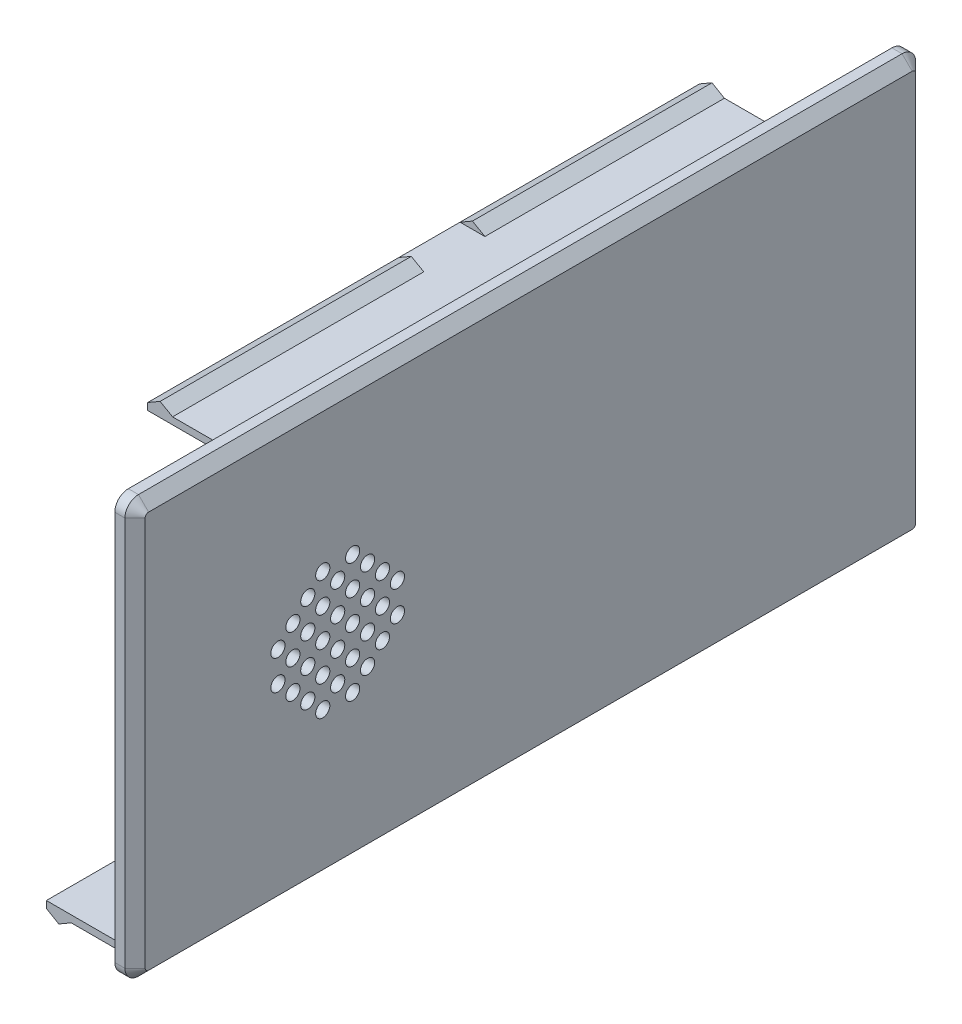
from build123d import *

# Parameters (mm, degrees)
SKETCH2_W                      = 99.1126
SKETCH2_H                      = 52.28
BOSS_EXTRUDE1_DEPTH            = 2.54
SKETCH3_W                      = 95.8426
SKETCH3_H                      = 48.58
SKETCH3_W_2                    = 94.1026
SKETCH3_H_2                    = 46.84
EXTRUDE_THIN1_DEPTH            = 0.762
BOSS_EXTRUDE2_DEPTH            = 95.8426
FILLET1_R                      = 1.7
SKETCH5_W                      = 3.885685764
SKETCH5_H                      = 7.665354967
CUT_EXTRUDE1_DEPTH             = 112.652948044
CUT_EXTRUDE2_DEPTH             = 112.652948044
CUT_EXTRUDE2_DEPTH_BACK        = 112.652948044
SKETCH6_W                      = 9.232419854
SKETCH6_H                      = 13.97
CHAMFER1_SIZE                  = 1.27
CUT_EXTRUDE3_REACH             = 113.653
SKETCH7_W                      = 9.232419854
SKETCH7_H                      = 12.7
CUT_EXTRUDE3_DIRECTION_2_REACH = 113.653
SKETCH8_R                      = 0.889
CUT_EXTRUDE5_DEPTH             = 2.54


with BuildPart() as part:
    # Sketch2 → Boss-Extrude1 (new body)
    with BuildSketch(Plane(origin=(0, 0, 0), x_dir=(0, 0, -1), z_dir=(1, 0, 0))):
        with Locations((49.5563, 26.14)):
            Rectangle(SKETCH2_W, SKETCH2_H)
    extrude(amount=BOSS_EXTRUDE1_DEPTH)

    # Sketch3 → Extrude-Thin1 (add)
    with BuildSketch(Plane.ZY):
        with Locations((-49.3413, 26.14)):
            Rectangle(SKETCH3_W, SKETCH3_H)
        with Locations((-49.3413, 26.14)):
            Rectangle(SKETCH3_W_2, SKETCH3_H_2, mode=Mode.SUBTRACT)
    extrude(amount=EXTRUDE_THIN1_DEPTH)

    # Sketch4 → Boss-Extrude2 (add)
    with BuildSketch(Plane.XY.offset(-1.42)):
        Polygon((-0.762, 50.43), (-6.876689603, 50.43), (-8.435554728, 51.3300112), (-9.994419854, 50.43), (-9.994419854, 49.56), (-0.762, 49.56), align=None)
    boss_extrude2 = extrude(amount=-BOSS_EXTRUDE2_DEPTH)

    # Fillet1
    fillet1_edges = [part.edges().sort_by_distance(p)[0] for p in [
        (1.27, 52.28, 0),
        (1.27, 52.28, -99.1126),
        (1.27, 0, -99.1126),
        (1.27, 0, 0),
    ]]
    fillet(fillet1_edges, radius=FILLET1_R)

    # Sketch5 → Cut-Extrude1 (cut, through all)
    with BuildSketch(Plane(origin=(0, 50.43, 0), x_dir=(1, 0, 0), z_dir=(0, 1, 0))):
        with Locations((-8.051576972, 49.437459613)):
            Rectangle(SKETCH5_W, SKETCH5_H)
    cut_extrude1 = extrude(amount=CUT_EXTRUDE1_DEPTH, mode=Mode.SUBTRACT)

    # Mirror3: Boss-Extrude2, Cut-Extrude1 across plane
    add(boss_extrude2.mirror(Plane.ZX.offset(26.14)))
    add(cut_extrude1.mirror(Plane.ZX.offset(26.14)), mode=Mode.SUBTRACT)

    # Sketch6 → Cut-Extrude2 (cut, two sides: drawn at the far end of the back side and taken through both)
    with BuildSketch(Plane(origin=(0, 50.43, 0), x_dir=(1, 0, 0), z_dir=(0, 1, 0)).offset(-CUT_EXTRUDE2_DEPTH_BACK)):
        with Locations((-5.378209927, 90.2776)):
            Rectangle(SKETCH6_W, SKETCH6_H)
    extrude(amount=CUT_EXTRUDE2_DEPTH + CUT_EXTRUDE2_DEPTH_BACK, mode=Mode.SUBTRACT)

    # Chamfer1
    chamfer1_edges = [part.edges().sort_by_distance(p)[0] for p in [
        (2.54, 26.14, 0),
        (2.54, 52.28, -49.5563),
        (2.54, 0, -49.5563),
        (2.54, 26.14, -99.1126),
        (2.54, 0.497918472, -98.614681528),
        (2.54, 51.782081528, -98.614681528),
        (2.54, 0.497918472, -0.497918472),
        (2.54, 51.782081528, -0.497918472),
    ]]
    chamfer(chamfer1_edges, length=CHAMFER1_SIZE)

    # Sketch7 → Cut-Extrude3 (cut, up to next)
    with BuildSketch(Plane(origin=(0, 50.43, 0), x_dir=(1, 0, 0), z_dir=(0, 1, 0)), mode=Mode.PRIVATE) as cut_extrude3_sk1:
        with Locations((-5.378209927, 7.77)):
            Rectangle(SKETCH7_W, SKETCH7_H)
    cut_extrude3_tool1 = extrude(cut_extrude3_sk1.sketch, amount=-CUT_EXTRUDE3_REACH, mode=Mode.PRIVATE) & part.part
    add(cut_extrude3_tool1.solids().sort_by_distance((-5.37821, 50.43, -7.77))[0], mode=Mode.SUBTRACT)

    # Sketch7 → Cut-Extrude3 direction 2 (cut, up to next)
    with BuildSketch(Plane(origin=(0, 50.43, 0), x_dir=(1, 0, 0), z_dir=(0, 1, 0)), mode=Mode.PRIVATE) as cut_extrude3_direction_2_sk1:
        with Locations((-5.378209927, 7.77)):
            Rectangle(SKETCH7_W, SKETCH7_H)
    cut_extrude3_direction_2_tool1 = extrude(cut_extrude3_direction_2_sk1.sketch, amount=CUT_EXTRUDE3_DIRECTION_2_REACH, mode=Mode.PRIVATE) & part.part
    add(cut_extrude3_direction_2_tool1.solids().sort_by_distance((-5.37821, 50.43, -7.77))[0], mode=Mode.SUBTRACT)

    # Sketch8 → Cut-Extrude5 (cut)
    with BuildSketch(Plane(origin=(2.54, 0, 0), x_dir=(0, 0, -1), z_dir=(1, 0, 0))):
        with Locations((27.272418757, 33.629675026)):
            Circle(SKETCH8_R)
        with Locations((23.527581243, 33.629675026)):
            Circle(SKETCH8_R)
        with Locations((29.144837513, 31.75725627)):
            Circle(SKETCH8_R)
        with Locations((31.01725627, 29.884837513)):
            Circle(SKETCH8_R)
        with Locations((25.4, 31.75725627)):
            Circle(SKETCH8_R)
        with Locations((27.272418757, 29.884837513)):
            Circle(SKETCH8_R)
        with Locations((21.655162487, 31.75725627)):
            Circle(SKETCH8_R)
        with Locations((23.527581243, 29.884837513)):
            Circle(SKETCH8_R)
        with Locations((19.78274373, 29.884837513)):
            Circle(SKETCH8_R)
        with Locations((29.144837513, 28.012418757)):
            Circle(SKETCH8_R)
        with Locations((31.01725627, 26.14)):
            Circle(SKETCH8_R)
        with Locations((25.4, 28.012418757)):
            Circle(SKETCH8_R)
        with Locations((27.272418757, 26.14)):
            Circle(SKETCH8_R)
        with Locations((21.655162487, 28.012418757)):
            Circle(SKETCH8_R)
        with Locations((23.527581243, 26.14)):
            Circle(SKETCH8_R)
        with Locations((17.910324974, 28.012418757)):
            Circle(SKETCH8_R)
        with Locations((19.78274373, 26.14)):
            Circle(SKETCH8_R)
        with Locations((29.144837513, 24.267581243)):
            Circle(SKETCH8_R)
        with Locations((31.01725627, 22.395162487)):
            Circle(SKETCH8_R)
        with Locations((25.4, 24.267581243)):
            Circle(SKETCH8_R)
        with Locations((27.272418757, 22.395162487)):
            Circle(SKETCH8_R)
        with Locations((21.655162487, 24.267581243)):
            Circle(SKETCH8_R)
        with Locations((23.527581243, 22.395162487)):
            Circle(SKETCH8_R)
        with Locations((17.910324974, 24.267581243)):
            Circle(SKETCH8_R)
        with Locations((19.78274373, 22.395162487)):
            Circle(SKETCH8_R)
        with Locations((29.144837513, 20.52274373)):
            Circle(SKETCH8_R)
        with Locations((25.4, 20.52274373)):
            Circle(SKETCH8_R)
        with Locations((27.272418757, 18.650324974)):
            Circle(SKETCH8_R)
        with Locations((21.655162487, 20.52274373)):
            Circle(SKETCH8_R)
        with Locations((23.527581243, 18.650324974)):
            Circle(SKETCH8_R)
        with Locations((32.889675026, 28.012418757)):
            Circle(SKETCH8_R)
        with Locations((32.889675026, 24.267581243)):
            Circle(SKETCH8_R)
    extrude(amount=-CUT_EXTRUDE5_DEPTH, mode=Mode.SUBTRACT)


solid = part.part
